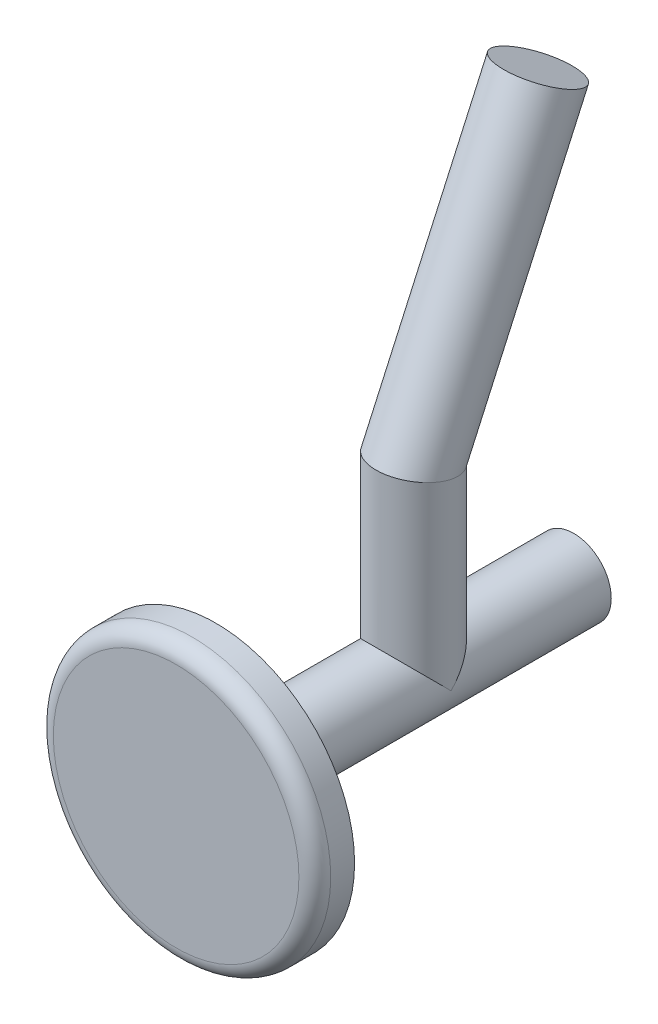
from build123d import *

# Parameters (mm, degrees)
ESQUISSE1_R             = 40
BOSS_EXTRU_1_DEPTH      = 150
CONG_1_R                = 5
ESQUISSE2_R             = 40
BOSS_EXTRU_2_DEPTH      = 50
BOSS_EXTRU_2_TAPER      = 24
ESQUISSE3_R             = 4.715984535
BOSS_EXTRU_3_DEPTH      = 50
ESQUISSE4_R             = 17.439965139
BOSS_EXTRU_4_DEPTH      = 5
CONG_2_R                = 2
ESQUISSE5_R             = 4.715984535
ESQUISSE7_R             = 147.328061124
ENL_V_MAT_EXTRU_1_DEPTH = 213.493333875


with BuildPart() as part:
    # Esquisse1 → Boss.-Extru.1 (new body)
    with BuildSketch(Plane.XY):
        Circle(ESQUISSE1_R)
    extrude(amount=BOSS_EXTRU_1_DEPTH)

    # Cong_1
    cong_1_edges = [part.edges().sort_by_distance(p)[0] for p in [
        (-40, 0, 0),
    ]]
    fillet(cong_1_edges, radius=CONG_1_R)

    # Esquisse2 → Boss.-Extru.2 (add)
    with BuildSketch(Plane.XY.offset(150)):
        Circle(ESQUISSE2_R)
    extrude(amount=BOSS_EXTRU_2_DEPTH, taper=BOSS_EXTRU_2_TAPER)

    # Esquisse3 → Boss.-Extru.3 (add)
    with BuildSketch(Plane.XY.offset(200)):
        Circle(ESQUISSE3_R)
    extrude(amount=BOSS_EXTRU_3_DEPTH)

    # Esquisse4 → Boss.-Extru.4 (add)
    with BuildSketch(Plane.XY.offset(250)):
        Circle(ESQUISSE4_R)
    extrude(amount=-BOSS_EXTRU_4_DEPTH)

    # Cong_2
    cong_2_edges = [part.edges().sort_by_distance(p)[0] for p in [
        (-17.439965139, 0, 250),
    ]]
    fillet(cong_2_edges, radius=CONG_2_R)

    # Balayage1: sweep along a path in Esquisse6
    with BuildLine(Plane(origin=(0, 0, 0), x_dir=(0, 0, -1), z_dir=(1, 0, 0))) as balayage1_path:
        Line((-220.147357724, 0), (-220.147357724, 23.018870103))
        Line((-220.147357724, 23.018870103), (-204.498740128, 57.669513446))
    # Esquisse5 → Balayage1 (sweep)
    with BuildSketch(Plane(origin=(0, 0, 0), x_dir=(1, 0, 0), z_dir=(0, 1, 0))):
        with Locations((0, -220.147357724)):
            Circle(ESQUISSE5_R)
    sweep(path=balayage1_path.line, transition=Transition.RIGHT)

    # Esquisse7 → Enl_v. mat.-Extru.1 (cut, through all)
    with BuildSketch(Plane.XY.offset(200)):
        Circle(ESQUISSE7_R)
    extrude(amount=-ENL_V_MAT_EXTRU_1_DEPTH, mode=Mode.SUBTRACT)


solid = part.part
